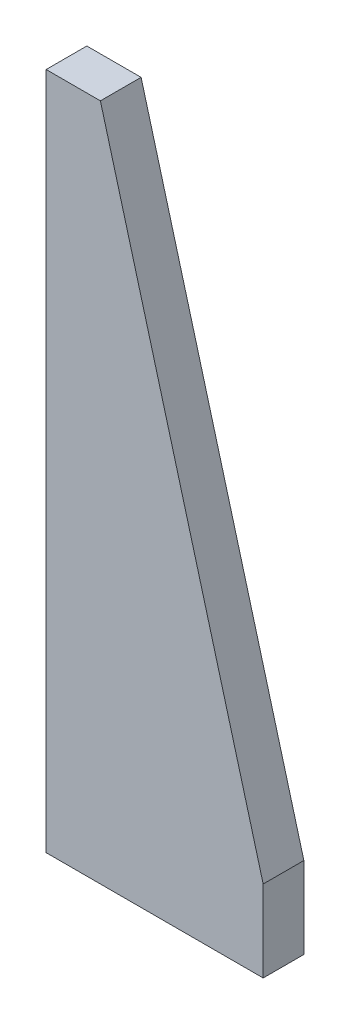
ISO-10303-21;
HEADER;
FILE_DESCRIPTION(('STEP AP214'),'2;1');
FILE_NAME('part.step','',(''),(''),'','','');
FILE_SCHEMA(('AUTOMOTIVE_DESIGN { 1 0 10303 214 1 1 1 1 }'));
ENDSEC;
DATA;
#1=APPLICATION_CONTEXT('core data for automotive mechanical design processes');
#2=APPLICATION_PROTOCOL_DEFINITION('international standard','automotive_design',2000,#1);
#3=PRODUCT_CONTEXT('',#1,'mechanical');
#4=PRODUCT('Part','Part','',(#3));
#5=PRODUCT_RELATED_PRODUCT_CATEGORY('part','',(#4));
#6=PRODUCT_DEFINITION_FORMATION('','',#4);
#7=PRODUCT_DEFINITION_CONTEXT('part definition',#1,'design');
#8=PRODUCT_DEFINITION('design','',#6,#7);
#9=PRODUCT_DEFINITION_SHAPE('','',#8);
#10=(LENGTH_UNIT() NAMED_UNIT(*) SI_UNIT(.MILLI.,.METRE.));
#11=(NAMED_UNIT(*) PLANE_ANGLE_UNIT() SI_UNIT($,.RADIAN.));
#12=(NAMED_UNIT(*) SI_UNIT($,.STERADIAN.) SOLID_ANGLE_UNIT());
#13=UNCERTAINTY_MEASURE_WITH_UNIT(LENGTH_MEASURE(1.E-05),#10,'distance_accuracy_value','');
#14=(GEOMETRIC_REPRESENTATION_CONTEXT(3) GLOBAL_UNCERTAINTY_ASSIGNED_CONTEXT((#13)) GLOBAL_UNIT_ASSIGNED_CONTEXT((#10,
#11,#12)) REPRESENTATION_CONTEXT('',''));
#15=CARTESIAN_POINT('',(0.,0.,0.));
#16=DIRECTION('',(0.,0.,1.));
#17=DIRECTION('',(1.,0.,0.));
#18=AXIS2_PLACEMENT_3D('',#15,#16,#17);
#19=CARTESIAN_POINT('',(80.,0.,15.));
#20=DIRECTION('',(-1.,0.,0.));
#21=DIRECTION('',(0.,0.,1.));
#22=AXIS2_PLACEMENT_3D('',#19,#20,#21);
#23=PLANE('',#22);
#24=DIRECTION('',(0.,1.,0.));
#25=VECTOR('',#24,1.);
#26=CARTESIAN_POINT('',(80.,0.,0.));
#27=LINE('',#26,#25);
#28=CARTESIAN_POINT('',(80.,0.,0.));
#29=VERTEX_POINT('',#28);
#30=CARTESIAN_POINT('',(80.,30.,0.));
#31=VERTEX_POINT('',#30);
#32=EDGE_CURVE('E106',#29,#31,#27,.T.);
#33=ORIENTED_EDGE('',*,*,#32,.T.);
#34=DIRECTION('',(0.,0.,-1.));
#35=VECTOR('',#34,1.);
#36=CARTESIAN_POINT('',(80.,30.,15.));
#37=LINE('',#36,#35);
#38=CARTESIAN_POINT('',(80.,30.,15.));
#39=VERTEX_POINT('',#38);
#40=EDGE_CURVE('E11',#39,#31,#37,.T.);
#41=ORIENTED_EDGE('',*,*,#40,.F.);
#42=DIRECTION('',(0.,1.,0.));
#43=VECTOR('',#42,1.);
#44=CARTESIAN_POINT('',(80.,0.,15.));
#45=LINE('',#44,#43);
#46=CARTESIAN_POINT('',(80.,0.,15.));
#47=VERTEX_POINT('',#46);
#48=EDGE_CURVE('E114',#47,#39,#45,.T.);
#49=ORIENTED_EDGE('',*,*,#48,.F.);
#50=DIRECTION('',(0.,0.,-1.));
#51=VECTOR('',#50,1.);
#52=CARTESIAN_POINT('',(80.,0.,15.));
#53=LINE('',#52,#51);
#54=EDGE_CURVE('E102',#47,#29,#53,.T.);
#55=ORIENTED_EDGE('',*,*,#54,.T.);
#56=EDGE_LOOP('',(#33,#41,#49,#55));
#57=FACE_BOUND('',#56,.T.);
#58=ADVANCED_FACE('F32',(#57),#23,.F.);
#59=CARTESIAN_POINT('',(80.,30.,15.));
#60=DIRECTION('',(-0.964763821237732,-0.263117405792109,0.));
#61=DIRECTION('',(0.263117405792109,-0.964763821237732,0.));
#62=AXIS2_PLACEMENT_3D('',#59,#60,#61);
#63=PLANE('',#62);
#64=DIRECTION('',(-0.263117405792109,0.964763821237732,0.));
#65=VECTOR('',#64,1.);
#66=CARTESIAN_POINT('',(80.,30.,0.));
#67=LINE('',#66,#65);
#68=CARTESIAN_POINT('',(20.,250.,0.));
#69=VERTEX_POINT('',#68);
#70=EDGE_CURVE('E109',#31,#69,#67,.T.);
#71=ORIENTED_EDGE('',*,*,#70,.T.);
#72=DIRECTION('',(0.,0.,-1.));
#73=VECTOR('',#72,1.);
#74=CARTESIAN_POINT('',(20.,250.,15.));
#75=LINE('',#74,#73);
#76=CARTESIAN_POINT('',(20.,250.,15.));
#77=VERTEX_POINT('',#76);
#78=EDGE_CURVE('E40',#77,#69,#75,.T.);
#79=ORIENTED_EDGE('',*,*,#78,.F.);
#80=DIRECTION('',(-0.263117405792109,0.964763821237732,0.));
#81=VECTOR('',#80,1.);
#82=CARTESIAN_POINT('',(80.,30.,15.));
#83=LINE('',#82,#81);
#84=EDGE_CURVE('E82',#39,#77,#83,.T.);
#85=ORIENTED_EDGE('',*,*,#84,.F.);
#86=ORIENTED_EDGE('',*,*,#40,.T.);
#87=EDGE_LOOP('',(#71,#79,#85,#86));
#88=FACE_BOUND('',#87,.T.);
#89=ADVANCED_FACE('F133',(#88),#63,.F.);
#90=CARTESIAN_POINT('',(0.,250.,15.));
#91=DIRECTION('',(0.,-1.,0.));
#92=DIRECTION('',(0.,0.,-1.));
#93=AXIS2_PLACEMENT_3D('',#90,#91,#92);
#94=PLANE('',#93);
#95=DIRECTION('',(-1.,0.,0.));
#96=VECTOR('',#95,1.);
#97=CARTESIAN_POINT('',(0.,250.,0.));
#98=LINE('',#97,#96);
#99=CARTESIAN_POINT('',(0.,250.,0.));
#100=VERTEX_POINT('',#99);
#101=EDGE_CURVE('E97',#69,#100,#98,.T.);
#102=ORIENTED_EDGE('',*,*,#101,.T.);
#103=DIRECTION('',(0.,0.,-1.));
#104=VECTOR('',#103,1.);
#105=CARTESIAN_POINT('',(0.,250.,15.));
#106=LINE('',#105,#104);
#107=CARTESIAN_POINT('',(0.,250.,15.));
#108=VERTEX_POINT('',#107);
#109=EDGE_CURVE('E94',#108,#100,#106,.T.);
#110=ORIENTED_EDGE('',*,*,#109,.F.);
#111=DIRECTION('',(-1.,0.,0.));
#112=VECTOR('',#111,1.);
#113=CARTESIAN_POINT('',(0.,250.,15.));
#114=LINE('',#113,#112);
#115=EDGE_CURVE('E86',#77,#108,#114,.T.);
#116=ORIENTED_EDGE('',*,*,#115,.F.);
#117=ORIENTED_EDGE('',*,*,#78,.T.);
#118=EDGE_LOOP('',(#102,#110,#116,#117));
#119=FACE_BOUND('',#118,.T.);
#120=ADVANCED_FACE('F95',(#119),#94,.F.);
#121=CARTESIAN_POINT('',(0.,0.,15.));
#122=DIRECTION('',(1.,0.,0.));
#123=DIRECTION('',(0.,0.,-1.));
#124=AXIS2_PLACEMENT_3D('',#121,#122,#123);
#125=PLANE('',#124);
#126=DIRECTION('',(0.,-1.,0.));
#127=VECTOR('',#126,1.);
#128=CARTESIAN_POINT('',(0.,0.,0.));
#129=LINE('',#128,#127);
#130=CARTESIAN_POINT('',(0.,0.,0.));
#131=VERTEX_POINT('',#130);
#132=EDGE_CURVE('E68',#100,#131,#129,.T.);
#133=ORIENTED_EDGE('',*,*,#132,.T.);
#134=DIRECTION('',(0.,0.,-1.));
#135=VECTOR('',#134,1.);
#136=CARTESIAN_POINT('',(0.,0.,15.));
#137=LINE('',#136,#135);
#138=CARTESIAN_POINT('',(0.,0.,15.));
#139=VERTEX_POINT('',#138);
#140=EDGE_CURVE('E98',#139,#131,#137,.T.);
#141=ORIENTED_EDGE('',*,*,#140,.F.);
#142=DIRECTION('',(0.,-1.,0.));
#143=VECTOR('',#142,1.);
#144=CARTESIAN_POINT('',(0.,0.,15.));
#145=LINE('',#144,#143);
#146=EDGE_CURVE('E90',#108,#139,#145,.T.);
#147=ORIENTED_EDGE('',*,*,#146,.F.);
#148=ORIENTED_EDGE('',*,*,#109,.T.);
#149=EDGE_LOOP('',(#133,#141,#147,#148));
#150=FACE_BOUND('',#149,.T.);
#151=ADVANCED_FACE('F100',(#150),#125,.F.);
#152=CARTESIAN_POINT('',(80.,0.,15.));
#153=DIRECTION('',(0.,1.,0.));
#154=DIRECTION('',(-1.,0.,0.));
#155=AXIS2_PLACEMENT_3D('',#152,#153,#154);
#156=PLANE('',#155);
#157=DIRECTION('',(1.,0.,0.));
#158=VECTOR('',#157,1.);
#159=CARTESIAN_POINT('',(80.,0.,0.));
#160=LINE('',#159,#158);
#161=EDGE_CURVE('E74',#131,#29,#160,.T.);
#162=ORIENTED_EDGE('',*,*,#161,.T.);
#163=ORIENTED_EDGE('',*,*,#54,.F.);
#164=DIRECTION('',(1.,0.,0.));
#165=VECTOR('',#164,1.);
#166=CARTESIAN_POINT('',(80.,0.,15.));
#167=LINE('',#166,#165);
#168=EDGE_CURVE('E48',#139,#47,#167,.T.);
#169=ORIENTED_EDGE('',*,*,#168,.F.);
#170=ORIENTED_EDGE('',*,*,#140,.T.);
#171=EDGE_LOOP('',(#162,#163,#169,#170));
#172=FACE_BOUND('',#171,.T.);
#173=ADVANCED_FACE('F122',(#172),#156,.F.);
#174=CARTESIAN_POINT('',(0.,0.,15.));
#175=DIRECTION('',(0.,0.,-1.));
#176=DIRECTION('',(-1.,0.,0.));
#177=AXIS2_PLACEMENT_3D('',#174,#175,#176);
#178=PLANE('',#177);
#179=ORIENTED_EDGE('',*,*,#48,.T.);
#180=ORIENTED_EDGE('',*,*,#84,.T.);
#181=ORIENTED_EDGE('',*,*,#115,.T.);
#182=ORIENTED_EDGE('',*,*,#146,.T.);
#183=ORIENTED_EDGE('',*,*,#168,.T.);
#184=EDGE_LOOP('',(#179,#180,#181,#182,#183));
#185=FACE_BOUND('',#184,.T.);
#186=ADVANCED_FACE('F88',(#185),#178,.F.);
#187=CARTESIAN_POINT('',(0.,0.,0.));
#188=DIRECTION('',(0.,0.,-1.));
#189=DIRECTION('',(-1.,0.,0.));
#190=AXIS2_PLACEMENT_3D('',#187,#188,#189);
#191=PLANE('',#190);
#192=ORIENTED_EDGE('',*,*,#32,.F.);
#193=ORIENTED_EDGE('',*,*,#161,.F.);
#194=ORIENTED_EDGE('',*,*,#132,.F.);
#195=ORIENTED_EDGE('',*,*,#101,.F.);
#196=ORIENTED_EDGE('',*,*,#70,.F.);
#197=EDGE_LOOP('',(#192,#193,#194,#195,#196));
#198=FACE_BOUND('',#197,.T.);
#199=ADVANCED_FACE('F118',(#198),#191,.T.);
#200=CLOSED_SHELL('',(#58,#89,#120,#151,#173,#186,#199));
#201=MANIFOLD_SOLID_BREP('B2',#200);
#202=ADVANCED_BREP_SHAPE_REPRESENTATION('',(#18,#201),#14);
#203=SHAPE_DEFINITION_REPRESENTATION(#9,#202);
ENDSEC;
END-ISO-10303-21;
